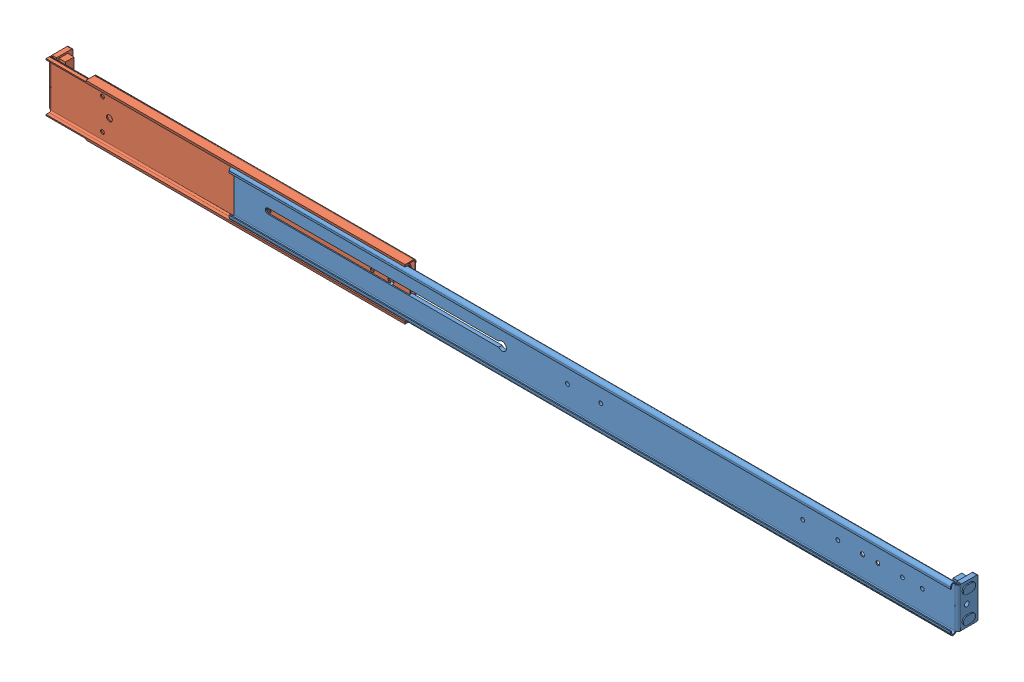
SolidWorks assembly Sliding Rail - Assembly.SLDASM, configuration Default (file format 15000). Lengths in mm.
Overall size (778.2 44 22.16).
2 component instances, 2 part files, 3 mates.
Components (placement in the parent):
- Sliding Rail - Front-1: Sliding Rail - Front.SLDPRT [Default] at origin size (618 39.25 21.23)
- Sliding Rail - Rear-1: Sliding Rail - Rear.SLDPRT [Default] at (-294.4002 0 -6.3593) x (1 0 0) z (0 0 -1) size (309.2 44 21.32)
Mates (geometry in assembly coordinates):
- Coincident1: coincident anti-aligned: plane of 01-SC81398-XX00C102-1 through (0 0 0) normal (0 1 0); plane of 01-SC81397-XX00C102-1 through (-294.4002 0 -6.3593) normal (0 -1 0)
- Coincident2: coincident anti-aligned: plane of 01-SC81398-XX00C102-1 through (0 0 -0.9296) normal (0 0 -1); plane of 01-SC81397-XX00C102-1 through (-294.4002 0 -0.9296) normal (0 0 1)
- LimitDistance1: limit distance = 112.75 mm aligned: plane of 01-SC81398-XX00C102-1 through (-45.6502 16.1704 -0.8796) normal (1 0 0); plane of 01-SC81397-XX00C102-1 through (-158.4002 -18.8707 -0.9296) normal (1 0 0)
